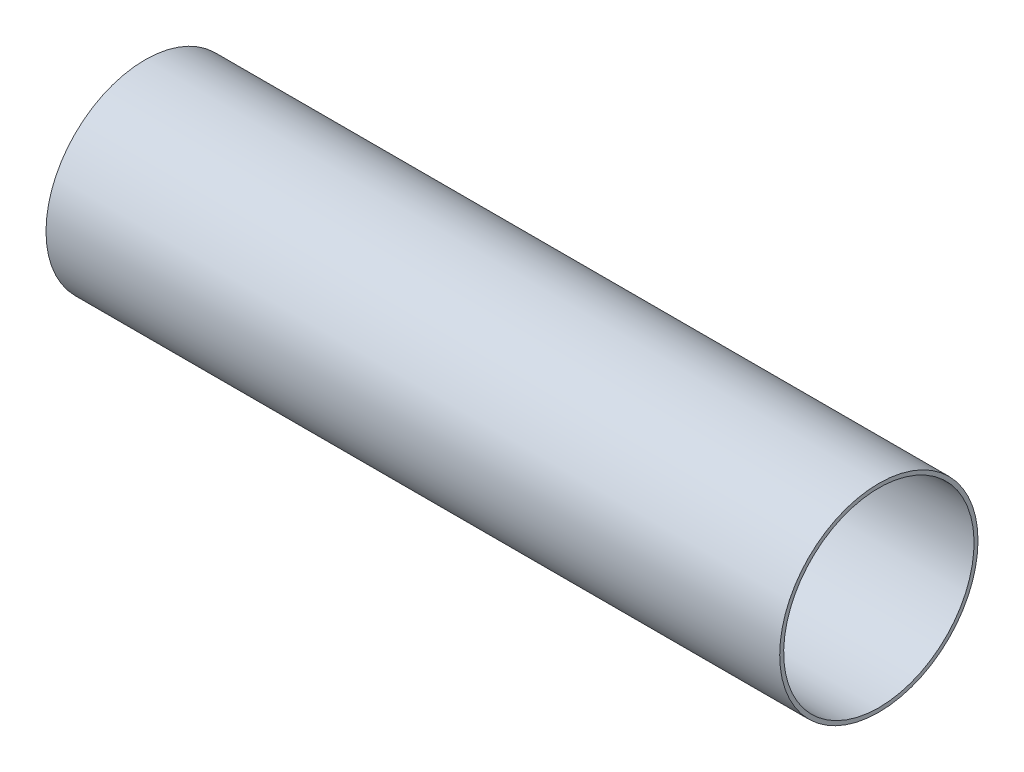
ISO-10303-21;
HEADER;
FILE_DESCRIPTION(('STEP AP214'),'2;1');
FILE_NAME('part.step','',(''),(''),'','','');
FILE_SCHEMA(('AUTOMOTIVE_DESIGN { 1 0 10303 214 1 1 1 1 }'));
ENDSEC;
DATA;
#1=APPLICATION_CONTEXT('core data for automotive mechanical design processes');
#2=APPLICATION_PROTOCOL_DEFINITION('international standard','automotive_design',2000,#1);
#3=PRODUCT_CONTEXT('',#1,'mechanical');
#4=PRODUCT('Part','Part','',(#3));
#5=PRODUCT_RELATED_PRODUCT_CATEGORY('part','',(#4));
#6=PRODUCT_DEFINITION_FORMATION('','',#4);
#7=PRODUCT_DEFINITION_CONTEXT('part definition',#1,'design');
#8=PRODUCT_DEFINITION('design','',#6,#7);
#9=PRODUCT_DEFINITION_SHAPE('','',#8);
#10=(LENGTH_UNIT() NAMED_UNIT(*) SI_UNIT(.MILLI.,.METRE.));
#11=(NAMED_UNIT(*) PLANE_ANGLE_UNIT() SI_UNIT($,.RADIAN.));
#12=(NAMED_UNIT(*) SI_UNIT($,.STERADIAN.) SOLID_ANGLE_UNIT());
#13=UNCERTAINTY_MEASURE_WITH_UNIT(LENGTH_MEASURE(1.E-05),#10,'distance_accuracy_value','');
#14=(GEOMETRIC_REPRESENTATION_CONTEXT(3) GLOBAL_UNCERTAINTY_ASSIGNED_CONTEXT((#13)) GLOBAL_UNIT_ASSIGNED_CONTEXT((#10,
#11,#12)) REPRESENTATION_CONTEXT('',''));
#15=CARTESIAN_POINT('',(0.,0.,0.));
#16=DIRECTION('',(0.,0.,1.));
#17=DIRECTION('',(1.,0.,0.));
#18=AXIS2_PLACEMENT_3D('',#15,#16,#17);
#19=CARTESIAN_POINT('',(-92.5,25.,0.));
#20=DIRECTION('',(1.,0.,0.));
#21=DIRECTION('',(0.,1.,0.));
#22=AXIS2_PLACEMENT_3D('',#19,#20,#21);
#23=PLANE('',#22);
#24=CARTESIAN_POINT('',(-92.5,0.,0.));
#25=DIRECTION('',(-1.,0.,0.));
#26=DIRECTION('',(0.,-1.,0.));
#27=AXIS2_PLACEMENT_3D('',#24,#25,#26);
#28=CIRCLE('',#27,24.);
#29=CARTESIAN_POINT('',(-92.5,-24.0000000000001,0.));
#30=VERTEX_POINT('',#29);
#31=EDGE_CURVE('E10',#30,#30,#28,.T.);
#32=ORIENTED_EDGE('',*,*,#31,.F.);
#33=EDGE_LOOP('',(#32));
#34=FACE_BOUND('',#33,.T.);
#35=CARTESIAN_POINT('',(-92.5,0.,0.));
#36=DIRECTION('',(-1.,0.,0.));
#37=DIRECTION('',(0.,-1.,0.));
#38=AXIS2_PLACEMENT_3D('',#35,#36,#37);
#39=CIRCLE('',#38,25.);
#40=CARTESIAN_POINT('',(-92.5,-25.0000000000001,0.));
#41=VERTEX_POINT('',#40);
#42=EDGE_CURVE('E40',#41,#41,#39,.T.);
#43=ORIENTED_EDGE('',*,*,#42,.T.);
#44=EDGE_LOOP('',(#43));
#45=FACE_BOUND('',#44,.T.);
#46=ADVANCED_FACE('F26',(#34,#45),#23,.F.);
#47=CARTESIAN_POINT('',(-141.928011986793,0.,0.));
#48=DIRECTION('',(-1.,0.,0.));
#49=DIRECTION('',(0.,-1.,0.));
#50=AXIS2_PLACEMENT_3D('',#47,#48,#49);
#51=CYLINDRICAL_SURFACE('',#50,24.);
#52=CARTESIAN_POINT('',(92.5,0.,0.));
#53=DIRECTION('',(-1.,0.,0.));
#54=DIRECTION('',(0.,-1.,0.));
#55=AXIS2_PLACEMENT_3D('',#52,#53,#54);
#56=CIRCLE('',#55,24.);
#57=CARTESIAN_POINT('',(92.5,-24.,0.));
#58=VERTEX_POINT('',#57);
#59=EDGE_CURVE('E32',#58,#58,#56,.T.);
#60=ORIENTED_EDGE('',*,*,#59,.F.);
#61=EDGE_LOOP('',(#60));
#62=FACE_BOUND('',#61,.T.);
#63=ORIENTED_EDGE('',*,*,#31,.T.);
#64=EDGE_LOOP('',(#63));
#65=FACE_BOUND('',#64,.T.);
#66=ADVANCED_FACE('F55',(#62,#65),#51,.F.);
#67=CARTESIAN_POINT('',(92.5,25.,0.));
#68=DIRECTION('',(-1.,0.,0.));
#69=DIRECTION('',(0.,-1.,0.));
#70=AXIS2_PLACEMENT_3D('',#67,#68,#69);
#71=PLANE('',#70);
#72=CARTESIAN_POINT('',(92.5,0.,0.));
#73=DIRECTION('',(-1.,0.,0.));
#74=DIRECTION('',(0.,-1.,0.));
#75=AXIS2_PLACEMENT_3D('',#72,#73,#74);
#76=CIRCLE('',#75,25.);
#77=CARTESIAN_POINT('',(92.5,-25.,0.));
#78=VERTEX_POINT('',#77);
#79=EDGE_CURVE('E36',#78,#78,#76,.T.);
#80=ORIENTED_EDGE('',*,*,#79,.F.);
#81=EDGE_LOOP('',(#80));
#82=FACE_BOUND('',#81,.T.);
#83=ORIENTED_EDGE('',*,*,#59,.T.);
#84=EDGE_LOOP('',(#83));
#85=FACE_BOUND('',#84,.T.);
#86=ADVANCED_FACE('F50',(#82,#85),#71,.F.);
#87=CARTESIAN_POINT('',(-141.928011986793,0.,0.));
#88=DIRECTION('',(-1.,0.,0.));
#89=DIRECTION('',(0.,-1.,0.));
#90=AXIS2_PLACEMENT_3D('',#87,#88,#89);
#91=CYLINDRICAL_SURFACE('',#90,25.);
#92=ORIENTED_EDGE('',*,*,#42,.F.);
#93=EDGE_LOOP('',(#92));
#94=FACE_BOUND('',#93,.T.);
#95=ORIENTED_EDGE('',*,*,#79,.T.);
#96=EDGE_LOOP('',(#95));
#97=FACE_BOUND('',#96,.T.);
#98=ADVANCED_FACE('F47',(#94,#97),#91,.T.);
#99=CLOSED_SHELL('',(#46,#66,#86,#98));
#100=MANIFOLD_SOLID_BREP('B2',#99);
#101=ADVANCED_BREP_SHAPE_REPRESENTATION('',(#18,#100),#14);
#102=SHAPE_DEFINITION_REPRESENTATION(#9,#101);
ENDSEC;
END-ISO-10303-21;
